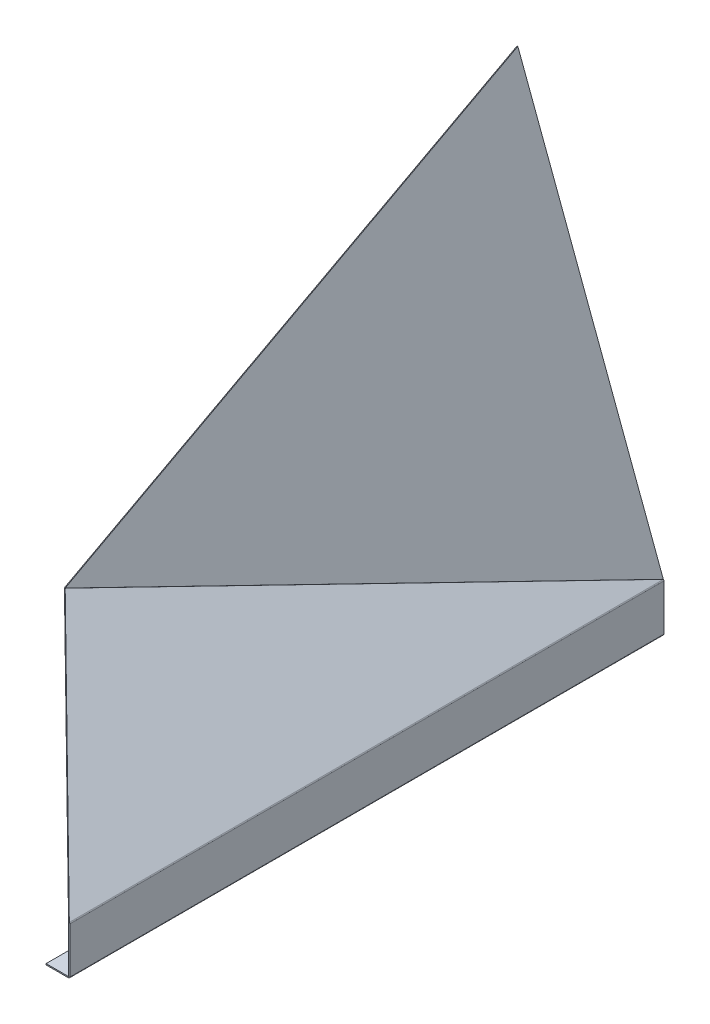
ISO-10303-21;
HEADER;
FILE_DESCRIPTION(('STEP AP214'),'2;1');
FILE_NAME('part.step','',(''),(''),'','','');
FILE_SCHEMA(('AUTOMOTIVE_DESIGN { 1 0 10303 214 1 1 1 1 }'));
ENDSEC;
DATA;
#1=APPLICATION_CONTEXT('core data for automotive mechanical design processes');
#2=APPLICATION_PROTOCOL_DEFINITION('international standard','automotive_design',2000,#1);
#3=PRODUCT_CONTEXT('',#1,'mechanical');
#4=PRODUCT('Part','Part','',(#3));
#5=PRODUCT_RELATED_PRODUCT_CATEGORY('part','',(#4));
#6=PRODUCT_DEFINITION_FORMATION('','',#4);
#7=PRODUCT_DEFINITION_CONTEXT('part definition',#1,'design');
#8=PRODUCT_DEFINITION('design','',#6,#7);
#9=PRODUCT_DEFINITION_SHAPE('','',#8);
#10=(LENGTH_UNIT() NAMED_UNIT(*) SI_UNIT(.MILLI.,.METRE.));
#11=(NAMED_UNIT(*) PLANE_ANGLE_UNIT() SI_UNIT($,.RADIAN.));
#12=(NAMED_UNIT(*) SI_UNIT($,.STERADIAN.) SOLID_ANGLE_UNIT());
#13=UNCERTAINTY_MEASURE_WITH_UNIT(LENGTH_MEASURE(1.E-05),#10,'distance_accuracy_value','');
#14=(GEOMETRIC_REPRESENTATION_CONTEXT(3) GLOBAL_UNCERTAINTY_ASSIGNED_CONTEXT((#13)) GLOBAL_UNIT_ASSIGNED_CONTEXT((#10,
#11,#12)) REPRESENTATION_CONTEXT('',''));
#15=CARTESIAN_POINT('',(0.,0.,0.));
#16=DIRECTION('',(0.,0.,1.));
#17=DIRECTION('',(1.,0.,0.));
#18=AXIS2_PLACEMENT_3D('',#15,#16,#17);
#19=CARTESIAN_POINT('',(-0.191461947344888,80.1345475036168,-499.663251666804));
#20=CARTESIAN_POINT('',(-0.484091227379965,80.380092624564,-499.955464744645));
#21=CARTESIAN_POINT('',(-0.688567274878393,80.726364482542,-500.245708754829));
#22=CARTESIAN_POINT('',(-0.771573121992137,81.1211835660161,-500.507511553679));
#23=CARTESIAN_POINT('',(-0.178606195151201,80.1498683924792,-499.663251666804));
#24=CARTESIAN_POINT('',(-0.468649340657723,80.3932434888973,-499.953875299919));
#25=CARTESIAN_POINT('',(-0.671240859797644,80.7365481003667,-500.242544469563));
#26=CARTESIAN_POINT('',(-0.753324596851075,81.1280121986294,-500.502999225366));
#27=CARTESIAN_POINT('',(1.10696902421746,81.6819572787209,-499.663251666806));
#28=CARTESIAN_POINT('',(1.07553933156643,81.708329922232,-499.794930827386));
#29=CARTESIAN_POINT('',(1.0614006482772,81.7549098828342,-499.926115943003));
#30=CARTESIAN_POINT('',(1.07152791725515,81.8108754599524,-500.051766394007));
#31=B_SPLINE_SURFACE_WITH_KNOTS('',1,3,((#19,#20,#21,#22),(#23,#24,#25,#26),(#27,#28,#29,#30)),
.UNSPECIFIED.,.F.,.F.,.F.,(2,1,2),(4,4),(-0.01,0.,1.),(0.,1.),.UNSPECIFIED.);
#32=DIRECTION('',(0.893352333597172,0.402217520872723,0.2003563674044));
#33=VECTOR('',#32,1.);
#34=CARTESIAN_POINT('',(0.175514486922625,81.3885003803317,-500.20565147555));
#35=LINE('',#34,#33);
#36=CARTESIAN_POINT('',(-0.717837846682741,80.9862828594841,-500.406007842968));
#37=VERTEX_POINT('',#36);
#38=CARTESIAN_POINT('',(1.06150390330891,81.7874028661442,-500.00694642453));
#39=VERTEX_POINT('',#38);
#40=EDGE_CURVE('E288',#37,#39,#35,.T.);
#41=CARTESIAN_POINT('',(1.06886682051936,81.7907179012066,-500.005295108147));
#42=VERTEX_POINT('',#41);
#43=EDGE_CURVE('E205',#39,#42,#35,.T.);
#44=CARTESIAN_POINT('',(1.10696902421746,81.6819572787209,-499.663251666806));
#45=CARTESIAN_POINT('',(1.09743986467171,81.6899175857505,-499.703115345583));
#46=CARTESIAN_POINT('',(1.08947641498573,81.6997489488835,-499.742984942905));
#47=CARTESIAN_POINT('',(1.07712185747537,81.7225459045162,-499.822380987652));
#48=CARTESIAN_POINT('',(1.07273075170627,81.7355114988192,-499.861907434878));
#49=CARTESIAN_POINT('',(1.06879704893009,81.7589849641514,-499.926539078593));
#50=CARTESIAN_POINT('',(1.06809488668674,81.7687628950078,-499.9518460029));
#51=CARTESIAN_POINT('',(1.06846223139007,81.7892030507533,-500.002098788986));
#52=CARTESIAN_POINT('',(1.06953243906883,81.799865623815,-500.027044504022));
#53=CARTESIAN_POINT('',(1.07152791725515,81.8108754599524,-500.051766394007));
#54=B_SPLINE_CURVE_WITH_KNOTS('',3,(#44,#45,#46,#47,#48,#49,#50,#51,#52,#53),.UNSPECIFIED.,.F.,
.F.,(4,2,2,2,4),(0.,0.125204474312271,0.250409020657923,0.331756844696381,0.413136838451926),.UNSPECIFIED.);
#55=CARTESIAN_POINT('',(1.10696902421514,81.6819572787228,-499.663251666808));
#56=VERTEX_POINT('',#55);
#57=EDGE_CURVE('E204',#56,#42,#54,.T.);
#58=DIRECTION('',(-0.642787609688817,-0.766044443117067,-1.40415457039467E-12));
#59=VECTOR('',#58,1.);
#60=CARTESIAN_POINT('',(1.10696902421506,81.6819572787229,-499.663251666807));
#61=LINE('',#60,#59);
#62=CARTESIAN_POINT('',(-0.178606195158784,80.1498683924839,-499.663251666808));
#63=VERTEX_POINT('',#62);
#64=EDGE_CURVE('E231',#56,#63,#61,.T.);
#65=CARTESIAN_POINT('',(-0.178606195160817,80.1498683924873,-499.663251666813));
#66=CARTESIAN_POINT('',(-0.216124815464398,80.1813456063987,-499.700843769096));
#67=CARTESIAN_POINT('',(-0.252233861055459,80.2144990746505,-499.738435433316));
#68=CARTESIAN_POINT('',(-0.321424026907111,80.2839451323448,-499.81347179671));
#69=CARTESIAN_POINT('',(-0.354506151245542,80.3202366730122,-499.850916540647));
#70=CARTESIAN_POINT('',(-0.417459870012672,80.3957678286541,-499.925539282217));
#71=CARTESIAN_POINT('',(-0.447331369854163,80.4350075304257,-499.962717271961));
#72=CARTESIAN_POINT('',(-0.503687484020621,80.516205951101,-500.036673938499));
#73=CARTESIAN_POINT('',(-0.530171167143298,80.5581654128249,-500.073452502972));
#74=CARTESIAN_POINT('',(-0.600739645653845,80.6815828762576,-500.17775937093));
#75=CARTESIAN_POINT('',(-0.640499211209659,80.7661224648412,-500.244676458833));
#76=CARTESIAN_POINT('',(-0.69030130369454,80.8981368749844,-500.343092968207));
#77=CARTESIAN_POINT('',(-0.70527666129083,80.9430765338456,-500.375616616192));
#78=CARTESIAN_POINT('',(-0.731848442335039,81.0344605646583,-500.439897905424));
#79=CARTESIAN_POINT('',(-0.743445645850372,81.0809045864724,-500.471655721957));
#80=CARTESIAN_POINT('',(-0.753324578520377,81.1280121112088,-500.502999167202));
#81=B_SPLINE_CURVE_WITH_KNOTS('',3,(#65,#66,#67,#68,#69,#70,#71,#72,#73,#74,#75,#76,#77,#78,#79,
#80),.UNSPECIFIED.,.F.,.F.,(4,2,2,2,2,2,2,4),(0.,0.185172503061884,0.370283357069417,
0.555399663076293,0.740566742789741,1.08414490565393,1.25642264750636,1.42866057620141),.UNSPECIFIED.);
#82=EDGE_CURVE('E227',#63,#37,#81,.T.);
#83=ORIENTED_EDGE('',*,*,#40,.T.);
#84=ORIENTED_EDGE('',*,*,#43,.T.);
#85=ORIENTED_EDGE('',*,*,#57,.F.);
#86=ORIENTED_EDGE('',*,*,#64,.T.);
#87=ORIENTED_EDGE('',*,*,#82,.T.);
#88=EDGE_LOOP('',(#83,#84,#85,#86,#87));
#89=FACE_BOUND('',#88,.T.);
#90=ADVANCED_FACE('F42',(#89),#31,.F.);
#91=CARTESIAN_POINT('',(-265.267367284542,305.849268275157,240.234825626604));
#92=DIRECTION('',(-0.326148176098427,0.273670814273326,0.904837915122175));
#93=DIRECTION('',(-0.912426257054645,-0.34143163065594,-0.225616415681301));
#94=AXIS2_PLACEMENT_3D('',#91,#92,#93);
#95=CYLINDRICAL_SURFACE('',#94,2.50000000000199);
#96=DIRECTION('',(0.326148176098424,-0.273670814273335,-0.904837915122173));
#97=VECTOR('',#96,1.);
#98=CARTESIAN_POINT('',(-0.753324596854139,81.1280121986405,-500.50299922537));
#99=LINE('',#98,#97);
#100=CARTESIAN_POINT('',(-267.548432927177,304.995689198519,239.670784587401));
#101=VERTEX_POINT('',#100);
#102=CARTESIAN_POINT('',(-0.78780762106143,81.1569468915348,-500.407332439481));
#103=VERTEX_POINT('',#102);
#104=EDGE_CURVE('E211',#101,#103,#99,.T.);
#105=ORIENTED_EDGE('',*,*,#104,.T.);
#106=CARTESIAN_POINT('',(1.49325802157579,82.0105259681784,-499.843291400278));
#107=DIRECTION('',(-0.211306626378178,-0.0790713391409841,0.974216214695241));
#108=DIRECTION('',(-0.350468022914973,0.936574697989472,0.));
#109=AXIS2_PLACEMENT_3D('',#106,#107,#108);
#110=ELLIPSE('',#109,2.69168709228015,2.50000000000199);
#111=EDGE_CURVE('E178',#37,#103,#110,.F.);
#112=ORIENTED_EDGE('',*,*,#111,.F.);
#113=ORIENTED_EDGE('',*,*,#82,.F.);
#114=DIRECTION('',(-0.326148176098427,0.273670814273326,0.904837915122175));
#115=VECTOR('',#114,1.);
#116=CARTESIAN_POINT('',(-266.874336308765,303.934157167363,240.2348256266));
#117=LINE('',#116,#115);
#118=CARTESIAN_POINT('',(-266.874336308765,303.934157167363,240.2348256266));
#119=VERTEX_POINT('',#118);
#120=EDGE_CURVE('E223',#119,#63,#117,.F.);
#121=ORIENTED_EDGE('',*,*,#120,.F.);
#122=CARTESIAN_POINT('',(-265.267367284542,305.849268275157,240.234825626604));
#123=DIRECTION('',(-0.326148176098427,0.273670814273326,0.904837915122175));
#124=DIRECTION('',(0.940752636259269,0.,0.339093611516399));
#125=AXIS2_PLACEMENT_3D('',#122,#123,#124);
#126=CIRCLE('',#125,2.50000000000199);
#127=EDGE_CURVE('E220',#101,#119,#126,.T.);
#128=ORIENTED_EDGE('',*,*,#127,.F.);
#129=EDGE_LOOP('',(#105,#112,#113,#121,#128));
#130=FACE_BOUND('',#129,.T.);
#131=ADVANCED_FACE('F251',(#130),#95,.T.);
#132=CARTESIAN_POINT('',(-265.267367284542,305.849268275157,240.234825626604));
#133=DIRECTION('',(-0.326148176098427,0.273670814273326,0.904837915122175));
#134=DIRECTION('',(-0.912426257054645,-0.34143163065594,-0.225616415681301));
#135=AXIS2_PLACEMENT_3D('',#132,#133,#134);
#136=CYLINDRICAL_SURFACE('',#135,0.50000000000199);
#137=CARTESIAN_POINT('',(1.49325802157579,82.0105259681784,-499.843291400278));
#138=DIRECTION('',(0.0748515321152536,-0.681237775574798,0.728225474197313));
#139=DIRECTION('',(-0.402337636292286,0.647564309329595,0.647135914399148));
#140=AXIS2_PLACEMENT_3D('',#137,#138,#139);
#141=ELLIPSE('',#140,1.11587606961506,0.50000000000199);
#142=CARTESIAN_POINT('',(1.03704489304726,81.8398101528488,-499.95609960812));
#143=VERTEX_POINT('',#142);
#144=EDGE_CURVE('E175',#42,#143,#141,.F.);
#145=ORIENTED_EDGE('',*,*,#144,.T.);
#146=DIRECTION('',(-0.326148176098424,0.273670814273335,0.904837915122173));
#147=VECTOR('',#146,1.);
#148=CARTESIAN_POINT('',(1.07152791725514,81.8108754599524,-500.051766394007));
#149=LINE('',#148,#147);
#150=CARTESIAN_POINT('',(-265.723580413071,305.67855245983,240.122017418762));
#151=VERTEX_POINT('',#150);
#152=EDGE_CURVE('E200',#143,#151,#149,.T.);
#153=ORIENTED_EDGE('',*,*,#152,.T.);
#154=CARTESIAN_POINT('',(-265.267367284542,305.849268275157,240.234825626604));
#155=DIRECTION('',(-0.326148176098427,0.273670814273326,0.904837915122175));
#156=DIRECTION('',(0.940752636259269,0.,0.339093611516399));
#157=AXIS2_PLACEMENT_3D('',#154,#155,#156);
#158=CIRCLE('',#157,0.50000000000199);
#159=CARTESIAN_POINT('',(-265.588761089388,305.466246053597,240.234825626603));
#160=VERTEX_POINT('',#159);
#161=EDGE_CURVE('E217',#151,#160,#158,.T.);
#162=ORIENTED_EDGE('',*,*,#161,.T.);
#163=DIRECTION('',(-0.326148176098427,0.273670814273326,0.904837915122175));
#164=VECTOR('',#163,1.);
#165=CARTESIAN_POINT('',(-265.588761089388,305.466246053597,240.234825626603));
#166=LINE('',#165,#164);
#167=EDGE_CURVE('E219',#160,#56,#166,.F.);
#168=ORIENTED_EDGE('',*,*,#167,.T.);
#169=ORIENTED_EDGE('',*,*,#57,.T.);
#170=EDGE_LOOP('',(#145,#153,#162,#168,#169));
#171=FACE_BOUND('',#170,.T.);
#172=ADVANCED_FACE('F198',(#171),#136,.F.);
#173=CARTESIAN_POINT('',(-0.717883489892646,80.999094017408,-500.451232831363));
#174=DIRECTION('',(0.912426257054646,0.341431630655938,0.225616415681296));
#175=DIRECTION('',(-0.350468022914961,0.936574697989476,0.));
#176=AXIS2_PLACEMENT_3D('',#173,#174,#175);
#177=PLANE('',#176);
#178=DIRECTION('',(-0.350468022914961,0.936574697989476,0.));
#179=VECTOR('',#178,1.);
#180=CARTESIAN_POINT('',(-0.727405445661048,80.9955308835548,-500.407332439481));
#181=LINE('',#180,#179);
#182=CARTESIAN_POINT('',(-245.682622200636,735.602636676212,-500.407332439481));
#183=VERTEX_POINT('',#182);
#184=EDGE_CURVE('E182',#183,#103,#181,.F.);
#185=ORIENTED_EDGE('',*,*,#184,.T.);
#186=ORIENTED_EDGE('',*,*,#104,.F.);
#187=DIRECTION('',(0.0255288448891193,0.502743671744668,-0.864058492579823));
#188=VECTOR('',#187,1.);
#189=CARTESIAN_POINT('',(-267.548432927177,304.995689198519,239.670784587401));
#190=LINE('',#189,#188);
#191=EDGE_CURVE('E192',#101,#183,#190,.T.);
#192=ORIENTED_EDGE('',*,*,#191,.T.);
#193=EDGE_LOOP('',(#185,#186,#192));
#194=FACE_BOUND('',#193,.T.);
#195=ADVANCED_FACE('F258',(#194),#177,.F.);
#196=CARTESIAN_POINT('',(1.10696902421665,81.6819572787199,-500.));
#197=DIRECTION('',(0.912426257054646,0.341431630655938,0.225616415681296));
#198=DIRECTION('',(-0.350468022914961,0.936574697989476,0.));
#199=AXIS2_PLACEMENT_3D('',#196,#197,#198);
#200=PLANE('',#199);
#201=ORIENTED_EDGE('',*,*,#152,.F.);
#202=DIRECTION('',(0.350468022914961,-0.936574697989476,0.));
#203=VECTOR('',#202,1.);
#204=CARTESIAN_POINT('',(-243.857769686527,736.285499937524,-499.956099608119));
#205=LINE('',#204,#203);
#206=CARTESIAN_POINT('',(-243.857769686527,736.285499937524,-499.956099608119));
#207=VERTEX_POINT('',#206);
#208=EDGE_CURVE('E186',#207,#143,#205,.T.);
#209=ORIENTED_EDGE('',*,*,#208,.F.);
#210=DIRECTION('',(0.0255288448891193,0.502743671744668,-0.864058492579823));
#211=VECTOR('',#210,1.);
#212=CARTESIAN_POINT('',(-265.723580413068,305.678552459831,240.122017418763));
#213=LINE('',#212,#211);
#214=EDGE_CURVE('E193',#151,#207,#213,.T.);
#215=ORIENTED_EDGE('',*,*,#214,.F.);
#216=EDGE_LOOP('',(#201,#209,#215));
#217=FACE_BOUND('',#216,.T.);
#218=ADVANCED_FACE('F207',(#217),#200,.T.);
#219=CARTESIAN_POINT('',(1.28557521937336,81.532088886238,-500.));
#220=DIRECTION('',(0.642787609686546,0.766044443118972,0.));
#221=DIRECTION('',(-0.766044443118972,0.642787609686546,0.));
#222=AXIS2_PLACEMENT_3D('',#219,#220,#221);
#223=PLANE('',#222);
#224=DIRECTION('',(-0.693146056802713,0.581618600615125,-0.425756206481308));
#225=VECTOR('',#224,1.);
#226=CARTESIAN_POINT('',(-264.895615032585,304.884627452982,240.660581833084));
#227=LINE('',#226,#225);
#228=CARTESIAN_POINT('',(-264.895615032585,304.884627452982,240.660581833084));
#229=VERTEX_POINT('',#228);
#230=EDGE_CURVE('E713',#229,#160,#227,.T.);
#231=ORIENTED_EDGE('',*,*,#230,.F.);
#232=DIRECTION('',(0.326148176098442,-0.273670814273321,-0.904837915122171));
#233=VECTOR('',#232,1.);
#234=CARTESIAN_POINT('',(-265.221763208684,305.158298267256,241.565419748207));
#235=LINE('',#234,#233);
#236=CARTESIAN_POINT('',(-264.971658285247,304.948435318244,240.871549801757));
#237=VERTEX_POINT('',#236);
#238=EDGE_CURVE('E712',#237,#229,#235,.T.);
#239=ORIENTED_EDGE('',*,*,#238,.F.);
#240=DIRECTION('',(-0.614002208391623,0.515209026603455,-0.597964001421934));
#241=VECTOR('',#240,1.);
#242=CARTESIAN_POINT('',(1.10696902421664,81.6819572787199,500.));
#243=LINE('',#242,#241);
#244=CARTESIAN_POINT('',(1.10696902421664,81.6819572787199,500.));
#245=VERTEX_POINT('',#244);
#246=EDGE_CURVE('E326',#245,#237,#243,.T.);
#247=ORIENTED_EDGE('',*,*,#246,.F.);
#248=DIRECTION('',(0.,0.,-1.));
#249=VECTOR('',#248,1.);
#250=CARTESIAN_POINT('',(1.10696902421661,81.68195727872,-500.));
#251=LINE('',#250,#249);
#252=EDGE_CURVE('E316',#245,#56,#251,.T.);
#253=ORIENTED_EDGE('',*,*,#252,.T.);
#254=ORIENTED_EDGE('',*,*,#167,.F.);
#255=EDGE_LOOP('',(#231,#239,#247,#253,#254));
#256=FACE_BOUND('',#255,.T.);
#257=ADVANCED_FACE('F264',(#256),#223,.T.);
#258=CARTESIAN_POINT('',(2.63677968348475E-13,80.,-500.));
#259=DIRECTION('',(0.642787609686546,0.766044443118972,0.));
#260=DIRECTION('',(-0.766044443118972,0.642787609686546,0.));
#261=AXIS2_PLACEMENT_3D('',#258,#259,#260);
#262=PLANE('',#261);
#263=DIRECTION('',(-0.326148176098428,0.273670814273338,0.904837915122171));
#264=VECTOR('',#263,1.);
#265=CARTESIAN_POINT('',(0.646293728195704,79.457695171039,-499.603022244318));
#266=LINE('',#265,#264);
#267=CARTESIAN_POINT('',(-266.181190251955,303.352538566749,240.660581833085));
#268=VERTEX_POINT('',#267);
#269=CARTESIAN_POINT('',(-266.257233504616,303.416346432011,240.871549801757));
#270=VERTEX_POINT('',#269);
#271=EDGE_CURVE('E420',#268,#270,#266,.T.);
#272=ORIENTED_EDGE('',*,*,#271,.F.);
#273=DIRECTION('',(0.693146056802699,-0.581618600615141,0.425756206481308));
#274=VECTOR('',#273,1.);
#275=CARTESIAN_POINT('',(-266.827483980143,303.894843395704,240.263604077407));
#276=LINE('',#275,#274);
#277=EDGE_CURVE('E11',#119,#268,#276,.T.);
#278=ORIENTED_EDGE('',*,*,#277,.F.);
#279=ORIENTED_EDGE('',*,*,#120,.T.);
#280=DIRECTION('',(0.,0.,-1.));
#281=VECTOR('',#280,1.);
#282=CARTESIAN_POINT('',(-0.178606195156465,80.149868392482,500.));
#283=LINE('',#282,#281);
#284=CARTESIAN_POINT('',(-0.178606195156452,80.149868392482,500.));
#285=VERTEX_POINT('',#284);
#286=EDGE_CURVE('E332',#285,#63,#283,.T.);
#287=ORIENTED_EDGE('',*,*,#286,.F.);
#288=DIRECTION('',(-0.614002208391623,0.515209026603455,-0.597964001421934));
#289=VECTOR('',#288,1.);
#290=CARTESIAN_POINT('',(-0.178606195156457,80.149868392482,500.));
#291=LINE('',#290,#289);
#292=EDGE_CURVE('E413',#285,#270,#291,.T.);
#293=ORIENTED_EDGE('',*,*,#292,.T.);
#294=EDGE_LOOP('',(#272,#278,#279,#287,#293));
#295=FACE_BOUND('',#294,.T.);
#296=ADVANCED_FACE('F419',(#295),#262,.F.);
#297=CARTESIAN_POINT('',(1.10696902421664,81.6819572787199,500.));
#298=DIRECTION('',(0.458067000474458,-0.384363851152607,-0.801522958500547));
#299=DIRECTION('',(-0.614002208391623,0.515209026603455,-0.597964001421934));
#300=AXIS2_PLACEMENT_3D('',#297,#298,#299);
#301=PLANE('',#300);
#302=ORIENTED_EDGE('',*,*,#246,.T.);
#303=DIRECTION('',(0.642787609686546,0.766044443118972,0.));
#304=VECTOR('',#303,1.);
#305=CARTESIAN_POINT('',(-264.971658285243,304.948435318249,240.871549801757));
#306=LINE('',#305,#304);
#307=EDGE_CURVE('E50',#237,#270,#306,.F.);
#308=ORIENTED_EDGE('',*,*,#307,.T.);
#309=ORIENTED_EDGE('',*,*,#292,.F.);
#310=DIRECTION('',(0.642787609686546,0.766044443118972,0.));
#311=VECTOR('',#310,1.);
#312=CARTESIAN_POINT('',(-0.178606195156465,80.149868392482,500.));
#313=LINE('',#312,#311);
#314=EDGE_CURVE('E336',#285,#245,#313,.T.);
#315=ORIENTED_EDGE('',*,*,#314,.T.);
#316=EDGE_LOOP('',(#302,#308,#309,#315));
#317=FACE_BOUND('',#316,.T.);
#318=ADVANCED_FACE('F412',(#317),#301,.F.);
#319=CARTESIAN_POINT('',(2.,1.99999999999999,500.));
#320=DIRECTION('',(0.,0.,-1.));
#321=DIRECTION('',(-1.,0.,0.));
#322=AXIS2_PLACEMENT_3D('',#319,#320,#321);
#323=PLANE('',#322);
#324=DIRECTION('',(1.,0.,0.));
#325=VECTOR('',#324,1.);
#326=CARTESIAN_POINT('',(2.96420873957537E-13,79.7668461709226,500.));
#327=LINE('',#326,#325);
#328=CARTESIAN_POINT('',(2.96420873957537E-13,79.7668461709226,500.));
#329=VERTEX_POINT('',#328);
#330=CARTESIAN_POINT('',(2.00000000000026,79.7668461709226,500.));
#331=VERTEX_POINT('',#330);
#332=EDGE_CURVE('E347',#329,#331,#327,.T.);
#333=ORIENTED_EDGE('',*,*,#332,.F.);
#334=DIRECTION('',(0.,-1.,0.));
#335=VECTOR('',#334,1.);
#336=CARTESIAN_POINT('',(0.,2.,500.));
#337=LINE('',#336,#335);
#338=CARTESIAN_POINT('',(0.,2.5,500.));
#339=VERTEX_POINT('',#338);
#340=EDGE_CURVE('E362',#329,#339,#337,.T.);
#341=ORIENTED_EDGE('',*,*,#340,.T.);
#342=DIRECTION('',(1.,0.,0.));
#343=VECTOR('',#342,1.);
#344=CARTESIAN_POINT('',(0.,2.5,500.));
#345=LINE('',#344,#343);
#346=CARTESIAN_POINT('',(2.,2.49999999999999,500.));
#347=VERTEX_POINT('',#346);
#348=EDGE_CURVE('E350',#339,#347,#345,.T.);
#349=ORIENTED_EDGE('',*,*,#348,.T.);
#350=DIRECTION('',(0.,-1.,0.));
#351=VECTOR('',#350,1.);
#352=CARTESIAN_POINT('',(2.,1.99999999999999,500.));
#353=LINE('',#352,#351);
#354=EDGE_CURVE('E366',#331,#347,#353,.T.);
#355=ORIENTED_EDGE('',*,*,#354,.F.);
#356=EDGE_LOOP('',(#333,#341,#349,#355));
#357=FACE_BOUND('',#356,.T.);
#358=ADVANCED_FACE('F503',(#357),#323,.F.);
#359=CARTESIAN_POINT('',(2.00000000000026,80.,-500.));
#360=DIRECTION('',(0.,0.,1.));
#361=DIRECTION('',(1.,0.,0.));
#362=AXIS2_PLACEMENT_3D('',#359,#360,#361);
#363=PLANE('',#362);
#364=DIRECTION('',(1.,0.,0.));
#365=VECTOR('',#364,1.);
#366=CARTESIAN_POINT('',(1.91686944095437E-13,79.7668461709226,-500.));
#367=LINE('',#366,#365);
#368=CARTESIAN_POINT('',(2.61753350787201E-13,79.7668461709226,-500.));
#369=VERTEX_POINT('',#368);
#370=CARTESIAN_POINT('',(2.00000000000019,79.7668461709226,-500.));
#371=VERTEX_POINT('',#370);
#372=EDGE_CURVE('E345',#369,#371,#367,.T.);
#373=ORIENTED_EDGE('',*,*,#372,.T.);
#374=DIRECTION('',(0.,1.,0.));
#375=VECTOR('',#374,1.);
#376=CARTESIAN_POINT('',(2.00000000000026,80.,-500.));
#377=LINE('',#376,#375);
#378=CARTESIAN_POINT('',(2.,2.49999999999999,-500.));
#379=VERTEX_POINT('',#378);
#380=EDGE_CURVE('E368',#379,#371,#377,.T.);
#381=ORIENTED_EDGE('',*,*,#380,.F.);
#382=DIRECTION('',(1.,0.,0.));
#383=VECTOR('',#382,1.);
#384=CARTESIAN_POINT('',(0.,2.5,-500.));
#385=LINE('',#384,#383);
#386=CARTESIAN_POINT('',(0.,2.5,-500.));
#387=VERTEX_POINT('',#386);
#388=EDGE_CURVE('E355',#387,#379,#385,.T.);
#389=ORIENTED_EDGE('',*,*,#388,.F.);
#390=DIRECTION('',(0.,1.,0.));
#391=VECTOR('',#390,1.);
#392=CARTESIAN_POINT('',(2.62538851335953E-13,80.,-500.));
#393=LINE('',#392,#391);
#394=EDGE_CURVE('E364',#387,#369,#393,.T.);
#395=ORIENTED_EDGE('',*,*,#394,.T.);
#396=EDGE_LOOP('',(#373,#381,#389,#395));
#397=FACE_BOUND('',#396,.T.);
#398=ADVANCED_FACE('F439',(#397),#363,.F.);
#399=CARTESIAN_POINT('',(2.00000000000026,80.,500.));
#400=DIRECTION('',(-1.,0.,0.));
#401=DIRECTION('',(0.,-1.,0.));
#402=AXIS2_PLACEMENT_3D('',#399,#400,#401);
#403=PLANE('',#402);
#404=DIRECTION('',(0.,0.,-1.));
#405=VECTOR('',#404,1.);
#406=CARTESIAN_POINT('',(2.00000000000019,79.7668461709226,-500.));
#407=LINE('',#406,#405);
#408=EDGE_CURVE('E341',#371,#331,#407,.F.);
#409=ORIENTED_EDGE('',*,*,#408,.T.);
#410=ORIENTED_EDGE('',*,*,#354,.T.);
#411=DIRECTION('',(0.,0.,1.));
#412=VECTOR('',#411,1.);
#413=CARTESIAN_POINT('',(2.,2.5,500.));
#414=LINE('',#413,#412);
#415=EDGE_CURVE('E358',#379,#347,#414,.T.);
#416=ORIENTED_EDGE('',*,*,#415,.F.);
#417=ORIENTED_EDGE('',*,*,#380,.T.);
#418=EDGE_LOOP('',(#409,#410,#416,#417));
#419=FACE_BOUND('',#418,.T.);
#420=ADVANCED_FACE('F491',(#419),#403,.F.);
#421=CARTESIAN_POINT('',(2.62538851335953E-13,80.,500.));
#422=DIRECTION('',(-1.,0.,0.));
#423=DIRECTION('',(0.,-1.,0.));
#424=AXIS2_PLACEMENT_3D('',#421,#422,#423);
#425=PLANE('',#424);
#426=ORIENTED_EDGE('',*,*,#340,.F.);
#427=DIRECTION('',(0.,0.,-1.));
#428=VECTOR('',#427,1.);
#429=CARTESIAN_POINT('',(1.91686944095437E-13,79.7668461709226,-500.));
#430=LINE('',#429,#428);
#431=EDGE_CURVE('E57',#369,#329,#430,.F.);
#432=ORIENTED_EDGE('',*,*,#431,.F.);
#433=ORIENTED_EDGE('',*,*,#394,.F.);
#434=DIRECTION('',(0.,0.,-1.));
#435=VECTOR('',#434,1.);
#436=CARTESIAN_POINT('',(0.,2.5,500.));
#437=LINE('',#436,#435);
#438=EDGE_CURVE('E353',#339,#387,#437,.T.);
#439=ORIENTED_EDGE('',*,*,#438,.F.);
#440=EDGE_LOOP('',(#426,#432,#433,#439));
#441=FACE_BOUND('',#440,.T.);
#442=ADVANCED_FACE('F442',(#441),#425,.T.);
#443=CARTESIAN_POINT('',(0.,2.,500.));
#444=DIRECTION('',(0.,-1.,0.));
#445=DIRECTION('',(1.,0.,0.));
#446=AXIS2_PLACEMENT_3D('',#443,#444,#445);
#447=PLANE('',#446);
#448=DIRECTION('',(0.,0.,-1.));
#449=VECTOR('',#448,1.);
#450=CARTESIAN_POINT('',(-0.499999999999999,2.,-500.));
#451=LINE('',#450,#449);
#452=CARTESIAN_POINT('',(-0.499999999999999,2.,-500.));
#453=VERTEX_POINT('',#452);
#454=CARTESIAN_POINT('',(-0.499999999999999,2.,500.));
#455=VERTEX_POINT('',#454);
#456=EDGE_CURVE('E375',#453,#455,#451,.F.);
#457=ORIENTED_EDGE('',*,*,#456,.F.);
#458=DIRECTION('',(-1.,0.,0.));
#459=VECTOR('',#458,1.);
#460=CARTESIAN_POINT('',(0.,2.,-500.));
#461=LINE('',#460,#459);
#462=CARTESIAN_POINT('',(-38.,2.,-500.));
#463=VERTEX_POINT('',#462);
#464=EDGE_CURVE('E388',#453,#463,#461,.T.);
#465=ORIENTED_EDGE('',*,*,#464,.T.);
#466=DIRECTION('',(0.,0.,-1.));
#467=VECTOR('',#466,1.);
#468=CARTESIAN_POINT('',(-38.,2.,500.));
#469=LINE('',#468,#467);
#470=CARTESIAN_POINT('',(-38.,2.,500.));
#471=VERTEX_POINT('',#470);
#472=EDGE_CURVE('E407',#471,#463,#469,.T.);
#473=ORIENTED_EDGE('',*,*,#472,.F.);
#474=DIRECTION('',(-1.,0.,0.));
#475=VECTOR('',#474,1.);
#476=CARTESIAN_POINT('',(0.,2.,500.));
#477=LINE('',#476,#475);
#478=EDGE_CURVE('E397',#455,#471,#477,.T.);
#479=ORIENTED_EDGE('',*,*,#478,.F.);
#480=EDGE_LOOP('',(#457,#465,#473,#479));
#481=FACE_BOUND('',#480,.T.);
#482=ADVANCED_FACE('F44',(#481),#447,.F.);
#483=CARTESIAN_POINT('',(0.,0.,500.));
#484=DIRECTION('',(0.,-1.,0.));
#485=DIRECTION('',(1.,0.,0.));
#486=AXIS2_PLACEMENT_3D('',#483,#484,#485);
#487=PLANE('',#486);
#488=DIRECTION('',(-1.,0.,0.));
#489=VECTOR('',#488,1.);
#490=CARTESIAN_POINT('',(0.,0.,-500.));
#491=LINE('',#490,#489);
#492=CARTESIAN_POINT('',(-0.499999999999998,0.,-500.));
#493=VERTEX_POINT('',#492);
#494=CARTESIAN_POINT('',(-38.,0.,-500.));
#495=VERTEX_POINT('',#494);
#496=EDGE_CURVE('E395',#493,#495,#491,.T.);
#497=ORIENTED_EDGE('',*,*,#496,.F.);
#498=DIRECTION('',(0.,0.,-1.));
#499=VECTOR('',#498,1.);
#500=CARTESIAN_POINT('',(-0.499999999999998,0.,-500.));
#501=LINE('',#500,#499);
#502=CARTESIAN_POINT('',(-0.499999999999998,0.,500.));
#503=VERTEX_POINT('',#502);
#504=EDGE_CURVE('E379',#493,#503,#501,.F.);
#505=ORIENTED_EDGE('',*,*,#504,.T.);
#506=DIRECTION('',(-1.,0.,0.));
#507=VECTOR('',#506,1.);
#508=CARTESIAN_POINT('',(0.,0.,500.));
#509=LINE('',#508,#507);
#510=CARTESIAN_POINT('',(-38.,0.,500.));
#511=VERTEX_POINT('',#510);
#512=EDGE_CURVE('E402',#503,#511,#509,.T.);
#513=ORIENTED_EDGE('',*,*,#512,.T.);
#514=DIRECTION('',(0.,0.,-1.));
#515=VECTOR('',#514,1.);
#516=CARTESIAN_POINT('',(-38.,0.,500.));
#517=LINE('',#516,#515);
#518=EDGE_CURVE('E404',#511,#495,#517,.T.);
#519=ORIENTED_EDGE('',*,*,#518,.T.);
#520=EDGE_LOOP('',(#497,#505,#513,#519));
#521=FACE_BOUND('',#520,.T.);
#522=ADVANCED_FACE('F456',(#521),#487,.T.);
#523=CARTESIAN_POINT('',(0.,2.,-500.));
#524=DIRECTION('',(0.,0.,1.));
#525=DIRECTION('',(1.,0.,0.));
#526=AXIS2_PLACEMENT_3D('',#523,#524,#525);
#527=PLANE('',#526);
#528=DIRECTION('',(0.,-1.,0.));
#529=VECTOR('',#528,1.);
#530=CARTESIAN_POINT('',(-0.499999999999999,2.,-500.));
#531=LINE('',#530,#529);
#532=EDGE_CURVE('E383',#453,#493,#531,.T.);
#533=ORIENTED_EDGE('',*,*,#532,.T.);
#534=ORIENTED_EDGE('',*,*,#496,.T.);
#535=DIRECTION('',(0.,1.,0.));
#536=VECTOR('',#535,1.);
#537=CARTESIAN_POINT('',(-38.,0.,-500.));
#538=LINE('',#537,#536);
#539=EDGE_CURVE('E392',#495,#463,#538,.T.);
#540=ORIENTED_EDGE('',*,*,#539,.T.);
#541=ORIENTED_EDGE('',*,*,#464,.F.);
#542=EDGE_LOOP('',(#533,#534,#540,#541));
#543=FACE_BOUND('',#542,.T.);
#544=ADVANCED_FACE('F453',(#543),#527,.F.);
#545=CARTESIAN_POINT('',(-38.,0.,500.));
#546=DIRECTION('',(-1.,0.,0.));
#547=DIRECTION('',(0.,0.,1.));
#548=AXIS2_PLACEMENT_3D('',#545,#546,#547);
#549=PLANE('',#548);
#550=ORIENTED_EDGE('',*,*,#539,.F.);
#551=ORIENTED_EDGE('',*,*,#518,.F.);
#552=DIRECTION('',(0.,1.,0.));
#553=VECTOR('',#552,1.);
#554=CARTESIAN_POINT('',(-38.,0.,500.));
#555=LINE('',#554,#553);
#556=EDGE_CURVE('E399',#511,#471,#555,.T.);
#557=ORIENTED_EDGE('',*,*,#556,.T.);
#558=ORIENTED_EDGE('',*,*,#472,.T.);
#559=EDGE_LOOP('',(#550,#551,#557,#558));
#560=FACE_BOUND('',#559,.T.);
#561=ADVANCED_FACE('F462',(#560),#549,.T.);
#562=CARTESIAN_POINT('',(0.,2.,500.));
#563=DIRECTION('',(0.,0.,1.));
#564=DIRECTION('',(1.,0.,0.));
#565=AXIS2_PLACEMENT_3D('',#562,#563,#564);
#566=PLANE('',#565);
#567=DIRECTION('',(0.,-1.,0.));
#568=VECTOR('',#567,1.);
#569=CARTESIAN_POINT('',(-0.499999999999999,2.,500.));
#570=LINE('',#569,#568);
#571=EDGE_CURVE('E386',#455,#503,#570,.T.);
#572=ORIENTED_EDGE('',*,*,#571,.F.);
#573=ORIENTED_EDGE('',*,*,#478,.T.);
#574=ORIENTED_EDGE('',*,*,#556,.F.);
#575=ORIENTED_EDGE('',*,*,#512,.F.);
#576=EDGE_LOOP('',(#572,#573,#574,#575));
#577=FACE_BOUND('',#576,.T.);
#578=ADVANCED_FACE('F471',(#577),#566,.T.);
#579=CARTESIAN_POINT('',(-0.499999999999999,2.5,500.));
#580=DIRECTION('',(0.,0.,1.));
#581=DIRECTION('',(1.,0.,0.));
#582=AXIS2_PLACEMENT_3D('',#579,#580,#581);
#583=PLANE('',#582);
#584=ORIENTED_EDGE('',*,*,#348,.F.);
#585=CARTESIAN_POINT('',(-0.499999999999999,2.5,500.));
#586=DIRECTION('',(0.,0.,-1.));
#587=DIRECTION('',(-1.,0.,0.));
#588=AXIS2_PLACEMENT_3D('',#585,#586,#587);
#589=CIRCLE('',#588,0.5);
#590=EDGE_CURVE('E371',#455,#339,#589,.F.);
#591=ORIENTED_EDGE('',*,*,#590,.F.);
#592=ORIENTED_EDGE('',*,*,#571,.T.);
#593=CARTESIAN_POINT('',(-0.499999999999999,2.5,500.));
#594=DIRECTION('',(0.,0.,-1.));
#595=DIRECTION('',(-1.,0.,0.));
#596=AXIS2_PLACEMENT_3D('',#593,#594,#595);
#597=CIRCLE('',#596,2.5);
#598=EDGE_CURVE('E65',#503,#347,#597,.F.);
#599=ORIENTED_EDGE('',*,*,#598,.T.);
#600=EDGE_LOOP('',(#584,#591,#592,#599));
#601=FACE_BOUND('',#600,.T.);
#602=ADVANCED_FACE('F469',(#601),#583,.T.);
#603=CARTESIAN_POINT('',(-0.499999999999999,2.5,-500.));
#604=DIRECTION('',(0.,0.,1.));
#605=DIRECTION('',(1.,0.,0.));
#606=AXIS2_PLACEMENT_3D('',#603,#604,#605);
#607=PLANE('',#606);
#608=CARTESIAN_POINT('',(-0.499999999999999,2.5,-500.));
#609=DIRECTION('',(0.,0.,-1.));
#610=DIRECTION('',(-1.,0.,0.));
#611=AXIS2_PLACEMENT_3D('',#608,#609,#610);
#612=CIRCLE('',#611,0.5);
#613=EDGE_CURVE('E370',#387,#453,#612,.T.);
#614=ORIENTED_EDGE('',*,*,#613,.F.);
#615=ORIENTED_EDGE('',*,*,#388,.T.);
#616=CARTESIAN_POINT('',(-0.499999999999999,2.5,-500.));
#617=DIRECTION('',(0.,0.,-1.));
#618=DIRECTION('',(-1.,0.,0.));
#619=AXIS2_PLACEMENT_3D('',#616,#617,#618);
#620=CIRCLE('',#619,2.5);
#621=EDGE_CURVE('E374',#379,#493,#620,.T.);
#622=ORIENTED_EDGE('',*,*,#621,.T.);
#623=ORIENTED_EDGE('',*,*,#532,.F.);
#624=EDGE_LOOP('',(#614,#615,#622,#623));
#625=FACE_BOUND('',#624,.T.);
#626=ADVANCED_FACE('F449',(#625),#607,.F.);
#627=CARTESIAN_POINT('',(-0.499999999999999,2.5,-500.));
#628=DIRECTION('',(0.,0.,-1.));
#629=DIRECTION('',(1.,0.,0.));
#630=AXIS2_PLACEMENT_3D('',#627,#628,#629);
#631=CYLINDRICAL_SURFACE('',#630,2.5);
#632=ORIENTED_EDGE('',*,*,#504,.F.);
#633=ORIENTED_EDGE('',*,*,#621,.F.);
#634=ORIENTED_EDGE('',*,*,#415,.T.);
#635=ORIENTED_EDGE('',*,*,#598,.F.);
#636=EDGE_LOOP('',(#632,#633,#634,#635));
#637=FACE_BOUND('',#636,.T.);
#638=ADVANCED_FACE('F479',(#637),#631,.T.);
#639=CARTESIAN_POINT('',(-0.499999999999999,2.5,-500.));
#640=DIRECTION('',(0.,0.,-1.));
#641=DIRECTION('',(1.,0.,0.));
#642=AXIS2_PLACEMENT_3D('',#639,#640,#641);
#643=CYLINDRICAL_SURFACE('',#642,0.5);
#644=ORIENTED_EDGE('',*,*,#456,.T.);
#645=ORIENTED_EDGE('',*,*,#590,.T.);
#646=ORIENTED_EDGE('',*,*,#438,.T.);
#647=ORIENTED_EDGE('',*,*,#613,.T.);
#648=EDGE_LOOP('',(#644,#645,#646,#647));
#649=FACE_BOUND('',#648,.T.);
#650=ADVANCED_FACE('F445',(#649),#643,.F.);
#651=CARTESIAN_POINT('',(-0.499999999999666,79.7668461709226,500.));
#652=DIRECTION('',(0.,0.,1.));
#653=DIRECTION('',(1.,0.,0.));
#654=AXIS2_PLACEMENT_3D('',#651,#652,#653);
#655=PLANE('',#654);
#656=ORIENTED_EDGE('',*,*,#314,.F.);
#657=CARTESIAN_POINT('',(-0.499999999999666,79.7668461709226,500.));
#658=DIRECTION('',(0.,0.,-1.));
#659=DIRECTION('',(-1.,0.,0.));
#660=AXIS2_PLACEMENT_3D('',#657,#658,#659);
#661=CIRCLE('',#660,0.499999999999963);
#662=EDGE_CURVE('E337',#329,#285,#661,.F.);
#663=ORIENTED_EDGE('',*,*,#662,.F.);
#664=ORIENTED_EDGE('',*,*,#332,.T.);
#665=CARTESIAN_POINT('',(-0.499999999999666,79.7668461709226,500.));
#666=DIRECTION('',(0.,0.,-1.));
#667=DIRECTION('',(-1.,0.,0.));
#668=AXIS2_PLACEMENT_3D('',#665,#666,#667);
#669=CIRCLE('',#668,2.49999999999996);
#670=EDGE_CURVE('E343',#331,#245,#669,.F.);
#671=ORIENTED_EDGE('',*,*,#670,.T.);
#672=EDGE_LOOP('',(#656,#663,#664,#671));
#673=FACE_BOUND('',#672,.T.);
#674=ADVANCED_FACE('F431',(#673),#655,.T.);
#675=CARTESIAN_POINT('',(-0.499999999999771,79.7668461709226,-500.));
#676=DIRECTION('',(0.,0.,1.));
#677=DIRECTION('',(1.,0.,0.));
#678=AXIS2_PLACEMENT_3D('',#675,#676,#677);
#679=PLANE('',#678);
#680=CARTESIAN_POINT('',(-0.499999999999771,79.7668461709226,-500.));
#681=DIRECTION('',(0.,0.,-1.));
#682=DIRECTION('',(-1.,0.,0.));
#683=AXIS2_PLACEMENT_3D('',#680,#681,#682);
#684=CIRCLE('',#683,0.499999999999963);
#685=CARTESIAN_POINT('',(-0.178606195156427,80.149868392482,-500.));
#686=VERTEX_POINT('',#685);
#687=EDGE_CURVE('E327',#686,#369,#684,.T.);
#688=ORIENTED_EDGE('',*,*,#687,.F.);
#689=DIRECTION('',(0.642787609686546,0.766044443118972,0.));
#690=VECTOR('',#689,1.);
#691=CARTESIAN_POINT('',(-0.178606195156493,80.149868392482,-500.));
#692=LINE('',#691,#690);
#693=CARTESIAN_POINT('',(1.10696902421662,81.6819572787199,-500.));
#694=VERTEX_POINT('',#693);
#695=EDGE_CURVE('E328',#686,#694,#692,.T.);
#696=ORIENTED_EDGE('',*,*,#695,.T.);
#697=CARTESIAN_POINT('',(-0.499999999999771,79.7668461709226,-500.));
#698=DIRECTION('',(0.,0.,-1.));
#699=DIRECTION('',(-1.,0.,0.));
#700=AXIS2_PLACEMENT_3D('',#697,#698,#699);
#701=CIRCLE('',#700,2.49999999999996);
#702=EDGE_CURVE('E319',#694,#371,#701,.T.);
#703=ORIENTED_EDGE('',*,*,#702,.T.);
#704=ORIENTED_EDGE('',*,*,#372,.F.);
#705=EDGE_LOOP('',(#688,#696,#703,#704));
#706=FACE_BOUND('',#705,.T.);
#707=ADVANCED_FACE('F436',(#706),#679,.F.);
#708=CARTESIAN_POINT('',(-0.499999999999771,79.7668461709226,-500.));
#709=DIRECTION('',(0.,0.,-1.));
#710=DIRECTION('',(0.642787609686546,0.766044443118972,0.));
#711=AXIS2_PLACEMENT_3D('',#708,#709,#710);
#712=CYLINDRICAL_SURFACE('',#711,2.49999999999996);
#713=ORIENTED_EDGE('',*,*,#408,.F.);
#714=ORIENTED_EDGE('',*,*,#702,.F.);
#715=DIRECTION('',(4.47141033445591E-12,-8.73676489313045E-12,-1.));
#716=VECTOR('',#715,1.);
#717=CARTESIAN_POINT('',(1.10696902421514,81.6819572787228,-499.663251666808));
#718=LINE('',#717,#716);
#719=EDGE_CURVE('E234',#56,#694,#718,.T.);
#720=ORIENTED_EDGE('',*,*,#719,.F.);
#721=ORIENTED_EDGE('',*,*,#252,.F.);
#722=ORIENTED_EDGE('',*,*,#670,.F.);
#723=EDGE_LOOP('',(#713,#714,#720,#721,#722));
#724=FACE_BOUND('',#723,.T.);
#725=ADVANCED_FACE('F314',(#724),#712,.T.);
#726=CARTESIAN_POINT('',(-0.499999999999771,79.7668461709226,-500.));
#727=DIRECTION('',(0.,0.,-1.));
#728=DIRECTION('',(0.642787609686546,0.766044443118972,0.));
#729=AXIS2_PLACEMENT_3D('',#726,#727,#728);
#730=CYLINDRICAL_SURFACE('',#729,0.499999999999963);
#731=ORIENTED_EDGE('',*,*,#431,.T.);
#732=ORIENTED_EDGE('',*,*,#662,.T.);
#733=ORIENTED_EDGE('',*,*,#286,.T.);
#734=DIRECTION('',(0.,0.,-1.));
#735=VECTOR('',#734,1.);
#736=CARTESIAN_POINT('',(-0.178606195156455,80.149868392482,-500.));
#737=LINE('',#736,#735);
#738=EDGE_CURVE('E310',#686,#63,#737,.F.);
#739=ORIENTED_EDGE('',*,*,#738,.F.);
#740=ORIENTED_EDGE('',*,*,#687,.T.);
#741=EDGE_LOOP('',(#731,#732,#733,#739,#740));
#742=FACE_BOUND('',#741,.T.);
#743=ADVANCED_FACE('F427',(#742),#730,.F.);
#744=CARTESIAN_POINT('',(-264.895615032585,304.884627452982,240.660581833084));
#745=DIRECTION('',(-0.326148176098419,0.273670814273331,0.904837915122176));
#746=DIRECTION('',(0.940752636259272,0.,0.339093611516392));
#747=AXIS2_PLACEMENT_3D('',#744,#745,#746);
#748=PLANE('',#747);
#749=DIRECTION('',(-0.642787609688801,-0.766044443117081,-1.3942462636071E-12));
#750=VECTOR('',#749,1.);
#751=CARTESIAN_POINT('',(-265.588761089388,305.466246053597,240.234825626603));
#752=LINE('',#751,#750);
#753=EDGE_CURVE('E228',#160,#119,#752,.T.);
#754=ORIENTED_EDGE('',*,*,#753,.T.);
#755=ORIENTED_EDGE('',*,*,#277,.T.);
#756=DIRECTION('',(-0.642787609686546,-0.766044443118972,0.));
#757=VECTOR('',#756,1.);
#758=CARTESIAN_POINT('',(-264.895615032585,304.884627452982,240.660581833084));
#759=LINE('',#758,#757);
#760=EDGE_CURVE('E321',#229,#268,#759,.T.);
#761=ORIENTED_EDGE('',*,*,#760,.F.);
#762=ORIENTED_EDGE('',*,*,#230,.T.);
#763=EDGE_LOOP('',(#754,#755,#761,#762));
#764=FACE_BOUND('',#763,.T.);
#765=ADVANCED_FACE('F610',(#764),#748,.T.);
#766=CARTESIAN_POINT('',(-265.221763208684,305.158298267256,241.565419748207));
#767=DIRECTION('',(-0.693146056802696,0.581618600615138,-0.425756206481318));
#768=DIRECTION('',(-0.642787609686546,-0.766044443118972,0.));
#769=AXIS2_PLACEMENT_3D('',#766,#767,#768);
#770=PLANE('',#769);
#771=ORIENTED_EDGE('',*,*,#760,.T.);
#772=ORIENTED_EDGE('',*,*,#271,.T.);
#773=ORIENTED_EDGE('',*,*,#307,.F.);
#774=ORIENTED_EDGE('',*,*,#238,.T.);
#775=EDGE_LOOP('',(#771,#772,#773,#774));
#776=FACE_BOUND('',#775,.T.);
#777=ADVANCED_FACE('F641',(#776),#770,.T.);
#778=CARTESIAN_POINT('',(1.10696902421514,81.6819572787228,-499.663251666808));
#779=DIRECTION('',(-0.766044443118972,0.642787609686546,-9.04118326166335E-12));
#780=DIRECTION('',(-0.642787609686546,-0.766044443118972,0.));
#781=AXIS2_PLACEMENT_3D('',#778,#779,#780);
#782=PLANE('',#781);
#783=ORIENTED_EDGE('',*,*,#695,.F.);
#784=ORIENTED_EDGE('',*,*,#738,.T.);
#785=ORIENTED_EDGE('',*,*,#64,.F.);
#786=ORIENTED_EDGE('',*,*,#719,.T.);
#787=EDGE_LOOP('',(#783,#784,#785,#786));
#788=FACE_BOUND('',#787,.T.);
#789=ADVANCED_FACE('F307',(#788),#782,.T.);
#790=CARTESIAN_POINT('',(-265.267367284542,305.849268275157,240.234825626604));
#791=DIRECTION('',(0.326148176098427,-0.273670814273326,-0.904837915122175));
#792=DIRECTION('',(-0.940752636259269,0.,-0.339093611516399));
#793=AXIS2_PLACEMENT_3D('',#790,#791,#792);
#794=PLANE('',#793);
#795=ORIENTED_EDGE('',*,*,#161,.F.);
#796=DIRECTION('',(-0.912426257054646,-0.341431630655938,-0.225616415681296));
#797=VECTOR('',#796,1.);
#798=CARTESIAN_POINT('',(-265.723580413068,305.678552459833,240.122017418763));
#799=LINE('',#798,#797);
#800=EDGE_CURVE('E208',#151,#101,#799,.T.);
#801=ORIENTED_EDGE('',*,*,#800,.T.);
#802=ORIENTED_EDGE('',*,*,#127,.T.);
#803=ORIENTED_EDGE('',*,*,#753,.F.);
#804=EDGE_LOOP('',(#795,#801,#802,#803));
#805=FACE_BOUND('',#804,.T.);
#806=ADVANCED_FACE('F271',(#805),#794,.F.);
#807=CARTESIAN_POINT('',(-243.857769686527,736.285499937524,-499.956099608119));
#808=DIRECTION('',(-0.211306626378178,-0.0790713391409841,0.974216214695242));
#809=DIRECTION('',(0.350468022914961,-0.936574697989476,0.));
#810=AXIS2_PLACEMENT_3D('',#807,#808,#809);
#811=PLANE('',#810);
#812=DIRECTION('',(0.912426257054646,0.341431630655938,0.225616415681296));
#813=VECTOR('',#812,1.);
#814=CARTESIAN_POINT('',(-243.857769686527,736.285499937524,-499.956099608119));
#815=LINE('',#814,#813);
#816=EDGE_CURVE('E181',#207,#183,#815,.F.);
#817=ORIENTED_EDGE('',*,*,#816,.F.);
#818=ORIENTED_EDGE('',*,*,#208,.T.);
#819=DIRECTION('',(0.912426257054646,0.341431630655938,0.225616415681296));
#820=VECTOR('',#819,1.);
#821=CARTESIAN_POINT('',(1.03704489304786,81.8398101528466,-499.956099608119));
#822=LINE('',#821,#820);
#823=EDGE_CURVE('E171',#143,#103,#822,.F.);
#824=ORIENTED_EDGE('',*,*,#823,.T.);
#825=ORIENTED_EDGE('',*,*,#184,.F.);
#826=EDGE_LOOP('',(#817,#818,#824,#825));
#827=FACE_BOUND('',#826,.T.);
#828=ADVANCED_FACE('F187',(#827),#811,.F.);
#829=CARTESIAN_POINT('',(-265.723580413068,305.678552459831,240.122017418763));
#830=DIRECTION('',(0.408444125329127,-0.794149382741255,-0.450000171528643));
#831=DIRECTION('',(0.0255288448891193,0.502743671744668,-0.864058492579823));
#832=AXIS2_PLACEMENT_3D('',#829,#830,#831);
#833=PLANE('',#832);
#834=ORIENTED_EDGE('',*,*,#214,.T.);
#835=ORIENTED_EDGE('',*,*,#816,.T.);
#836=ORIENTED_EDGE('',*,*,#191,.F.);
#837=ORIENTED_EDGE('',*,*,#800,.F.);
#838=EDGE_LOOP('',(#834,#835,#836,#837));
#839=FACE_BOUND('',#838,.T.);
#840=ADVANCED_FACE('F265',(#839),#833,.F.);
#841=CARTESIAN_POINT('',(0.549907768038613,84.5314919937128,-499.843291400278));
#842=CARTESIAN_POINT('',(0.714704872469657,83.9320371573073,-499.602583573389));
#843=CARTESIAN_POINT('',(0.879501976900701,83.3325823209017,-499.3618757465));
#844=CARTESIAN_POINT('',(1.04429908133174,82.7331274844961,-499.121167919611));
#845=CARTESIAN_POINT('',(5.11203905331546,86.238650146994,-498.71520932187));
#846=CARTESIAN_POINT('',(4.06026781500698,85.1839531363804,-498.775323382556));
#847=CARTESIAN_POINT('',(3.00849657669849,84.1292561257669,-498.835437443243));
#848=CARTESIAN_POINT('',(1.95672533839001,83.0745591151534,-498.895551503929));
#849=CARTESIAN_POINT('',(6.99873956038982,81.1967180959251,-498.71520932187));
#850=CARTESIAN_POINT('',(5.61737411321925,81.3409307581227,-499.256739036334));
#851=CARTESIAN_POINT('',(4.23600866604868,81.4851434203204,-499.798268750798));
#852=CARTESIAN_POINT('',(2.85464321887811,81.629356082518,-500.339798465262));
#853=CARTESIAN_POINT('',(2.43660827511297,79.489559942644,-499.843291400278));
#854=CARTESIAN_POINT('',(2.27181117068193,80.0890147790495,-500.083999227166));
#855=CARTESIAN_POINT('',(2.10701406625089,80.6884696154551,-500.324707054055));
#856=CARTESIAN_POINT('',(1.94221696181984,81.2879244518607,-500.565414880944));
#857=CARTESIAN_POINT('',(-2.12552301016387,77.7824017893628,-500.971373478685));
#858=CARTESIAN_POINT('',(-1.07375177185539,78.8370987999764,-500.911259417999));
#859=CARTESIAN_POINT('',(-0.0219805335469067,79.8917958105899,-500.851145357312));
#860=CARTESIAN_POINT('',(1.02979070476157,80.9464928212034,-500.791031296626));
#861=CARTESIAN_POINT('',(-4.01222351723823,82.8243338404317,-500.971373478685));
#862=CARTESIAN_POINT('',(-2.63085807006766,82.6801211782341,-500.429843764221));
#863=CARTESIAN_POINT('',(-1.24949262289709,82.5359085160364,-499.888314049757));
#864=CARTESIAN_POINT('',(0.131872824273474,82.3916958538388,-499.346784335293));
#865=CARTESIAN_POINT('',(0.549907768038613,84.5314919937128,-499.843291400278));
#866=CARTESIAN_POINT('',(0.714704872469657,83.9320371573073,-499.602583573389));
#867=CARTESIAN_POINT('',(0.879501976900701,83.3325823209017,-499.3618757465));
#868=CARTESIAN_POINT('',(1.04429908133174,82.7331274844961,-499.121167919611));
#869=(BOUNDED_SURFACE() B_SPLINE_SURFACE(3,3,((#841,#842,#843,#844),(#845,#846,#847,#848),(#849,
#850,#851,#852),(#853,#854,#855,#856),(#857,#858,#859,#860),(#861,#862,#863,#864),(#865,#866,
#867,#868)),.UNSPECIFIED.,.T.,.F.,.F.) B_SPLINE_SURFACE_WITH_KNOTS((4,3,4),(4,4),(0.,0.5,1.),
(0.,1.),.UNSPECIFIED.) GEOMETRIC_REPRESENTATION_ITEM() RATIONAL_B_SPLINE_SURFACE(((1.,1.,1.,1.),
(0.333333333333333,0.333333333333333,0.333333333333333,0.333333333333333),(0.333333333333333,
0.333333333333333,0.333333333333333,0.333333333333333),(1.,1.,1.,1.),(0.333333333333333,
0.333333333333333,0.333333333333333,0.333333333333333),(0.333333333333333,0.333333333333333,
0.333333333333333,0.333333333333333),(1.,1.,1.,1.))) REPRESENTATION_ITEM('') SURFACE());
#870=ORIENTED_EDGE('',*,*,#111,.T.);
#871=ORIENTED_EDGE('',*,*,#823,.F.);
#872=ORIENTED_EDGE('',*,*,#144,.F.);
#873=ORIENTED_EDGE('',*,*,#43,.F.);
#874=ORIENTED_EDGE('',*,*,#40,.F.);
#875=EDGE_LOOP('',(#870,#871,#872,#873,#874));
#876=FACE_BOUND('',#875,.T.);
#877=ADVANCED_FACE('F173',(#876),#869,.T.);
#878=CLOSED_SHELL('',(#90,#131,#172,#195,#218,#257,#296,#318,#358,#398,#420,#442,#482,#522,#544,
#561,#578,#602,#626,#638,#650,#674,#707,#725,#743,#765,#777,#789,#806,#828,#840,#877));
#879=MANIFOLD_SOLID_BREP('B2',#878);
#880=ADVANCED_BREP_SHAPE_REPRESENTATION('',(#18,#879),#14);
#881=SHAPE_DEFINITION_REPRESENTATION(#9,#880);
ENDSEC;
END-ISO-10303-21;
